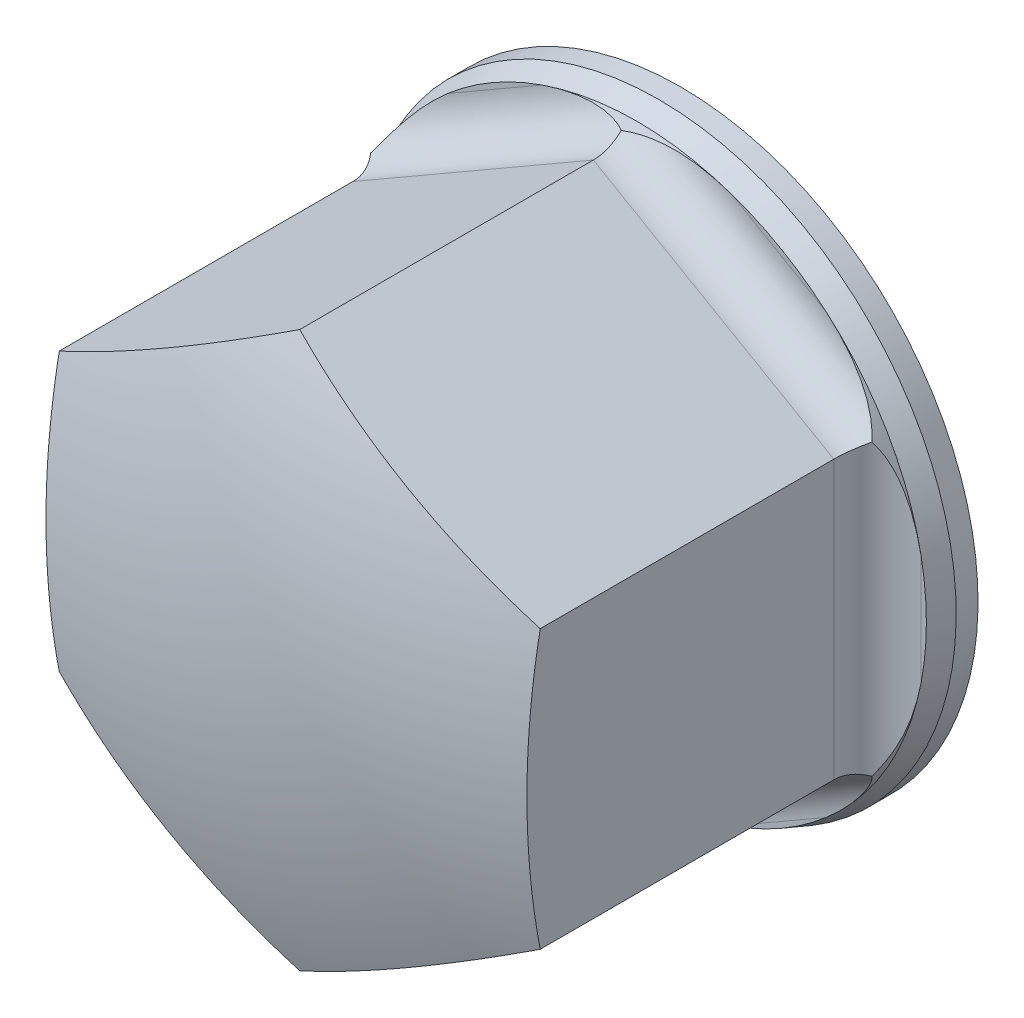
ISO-10303-21;
HEADER;
FILE_DESCRIPTION(('STEP AP214'),'2;1');
FILE_NAME('part.step','',(''),(''),'','','');
FILE_SCHEMA(('AUTOMOTIVE_DESIGN { 1 0 10303 214 1 1 1 1 }'));
ENDSEC;
DATA;
#1=APPLICATION_CONTEXT('core data for automotive mechanical design processes');
#2=APPLICATION_PROTOCOL_DEFINITION('international standard','automotive_design',2000,#1);
#3=PRODUCT_CONTEXT('',#1,'mechanical');
#4=PRODUCT('Part','Part','',(#3));
#5=PRODUCT_RELATED_PRODUCT_CATEGORY('part','',(#4));
#6=PRODUCT_DEFINITION_FORMATION('','',#4);
#7=PRODUCT_DEFINITION_CONTEXT('part definition',#1,'design');
#8=PRODUCT_DEFINITION('design','',#6,#7);
#9=PRODUCT_DEFINITION_SHAPE('','',#8);
#10=(LENGTH_UNIT() NAMED_UNIT(*) SI_UNIT(.MILLI.,.METRE.));
#11=(NAMED_UNIT(*) PLANE_ANGLE_UNIT() SI_UNIT($,.RADIAN.));
#12=(NAMED_UNIT(*) SI_UNIT($,.STERADIAN.) SOLID_ANGLE_UNIT());
#13=UNCERTAINTY_MEASURE_WITH_UNIT(LENGTH_MEASURE(1.E-05),#10,'distance_accuracy_value','');
#14=(GEOMETRIC_REPRESENTATION_CONTEXT(3) GLOBAL_UNCERTAINTY_ASSIGNED_CONTEXT((#13)) GLOBAL_UNIT_ASSIGNED_CONTEXT((#10,
#11,#12)) REPRESENTATION_CONTEXT('',''));
#15=CARTESIAN_POINT('',(0.,0.,0.));
#16=DIRECTION('',(0.,0.,1.));
#17=DIRECTION('',(1.,0.,0.));
#18=AXIS2_PLACEMENT_3D('',#15,#16,#17);
#19=CARTESIAN_POINT('',(0.,0.,0.));
#20=DIRECTION('',(0.,0.,-1.));
#21=DIRECTION('',(0.,1.,0.));
#22=AXIS2_PLACEMENT_3D('',#19,#20,#21);
#23=CYLINDRICAL_SURFACE('',#22,3.4);
#24=CARTESIAN_POINT('',(0.,0.,0.));
#25=DIRECTION('',(0.,0.,-1.));
#26=DIRECTION('',(0.,1.,0.));
#27=AXIS2_PLACEMENT_3D('',#24,#25,#26);
#28=CIRCLE('',#27,3.4);
#29=CARTESIAN_POINT('',(0.,3.4,0.));
#30=VERTEX_POINT('',#29);
#31=EDGE_CURVE('E177',#30,#30,#28,.T.);
#32=ORIENTED_EDGE('',*,*,#31,.F.);
#33=EDGE_LOOP('',(#32));
#34=FACE_BOUND('',#33,.T.);
#35=CARTESIAN_POINT('',(0.,0.,0.25));
#36=DIRECTION('',(0.,0.,-1.));
#37=DIRECTION('',(0.,1.,0.));
#38=AXIS2_PLACEMENT_3D('',#35,#36,#37);
#39=CIRCLE('',#38,3.4);
#40=CARTESIAN_POINT('',(0.,3.4,0.25));
#41=VERTEX_POINT('',#40);
#42=EDGE_CURVE('E138',#41,#41,#39,.T.);
#43=ORIENTED_EDGE('',*,*,#42,.T.);
#44=EDGE_LOOP('',(#43));
#45=FACE_BOUND('',#44,.T.);
#46=ADVANCED_FACE('F14',(#34,#45),#23,.T.);
#47=CARTESIAN_POINT('',(3.4,0.,0.));
#48=DIRECTION('',(0.,0.,1.));
#49=DIRECTION('',(0.,-1.,0.));
#50=AXIS2_PLACEMENT_3D('',#47,#48,#49);
#51=PLANE('',#50);
#52=CARTESIAN_POINT('',(0.,0.,0.));
#53=DIRECTION('',(0.,0.,-1.));
#54=DIRECTION('',(-1.,0.,0.));
#55=AXIS2_PLACEMENT_3D('',#52,#53,#54);
#56=CIRCLE('',#55,1.5);
#57=CARTESIAN_POINT('',(-1.5,0.,0.));
#58=VERTEX_POINT('',#57);
#59=EDGE_CURVE('E333',#58,#58,#56,.T.);
#60=ORIENTED_EDGE('',*,*,#59,.F.);
#61=EDGE_LOOP('',(#60));
#62=FACE_BOUND('',#61,.T.);
#63=ORIENTED_EDGE('',*,*,#31,.T.);
#64=EDGE_LOOP('',(#63));
#65=FACE_BOUND('',#64,.T.);
#66=ADVANCED_FACE('F317',(#62,#65),#51,.F.);
#67=CARTESIAN_POINT('',(0.,0.,0.25));
#68=DIRECTION('',(0.,0.,-1.));
#69=DIRECTION('',(0.,1.,0.));
#70=AXIS2_PLACEMENT_3D('',#67,#68,#69);
#71=CYLINDRICAL_SURFACE('',#70,3.30900744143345);
#72=CARTESIAN_POINT('',(-2.82661530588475,-1.7204,0.734019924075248));
#73=CARTESIAN_POINT('',(-2.83525178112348,-1.70621552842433,0.720292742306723));
#74=CARTESIAN_POINT('',(-2.84417088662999,-1.69131562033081,0.707555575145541));
#75=CARTESIAN_POINT('',(-2.86232343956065,-1.66040685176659,0.683881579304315));
#76=CARTESIAN_POINT('',(-2.87155581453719,-1.64440161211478,0.672939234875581));
#77=CARTESIAN_POINT('',(-2.89915169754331,-1.59556545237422,0.642726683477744));
#78=CARTESIAN_POINT('',(-2.91768845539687,-1.56146842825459,0.625669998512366));
#79=CARTESIAN_POINT('',(-2.95192436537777,-1.49561987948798,0.598043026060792));
#80=CARTESIAN_POINT('',(-2.96768584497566,-1.46411727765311,0.58692515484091));
#81=CARTESIAN_POINT('',(-2.9985032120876,-1.39991992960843,0.567470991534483));
#82=CARTESIAN_POINT('',(-3.01355876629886,-1.36722463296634,0.55913600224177));
#83=CARTESIAN_POINT('',(-3.04295367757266,-1.30050441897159,0.544583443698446));
#84=CARTESIAN_POINT('',(-3.05728030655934,-1.26646738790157,0.538396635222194));
#85=CARTESIAN_POINT('',(-3.08487374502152,-1.19768857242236,0.527822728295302));
#86=CARTESIAN_POINT('',(-3.09814028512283,-1.16294661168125,0.523436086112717));
#87=CARTESIAN_POINT('',(-3.12589431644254,-1.08640042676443,0.515393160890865));
#88=CARTESIAN_POINT('',(-3.14015094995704,-1.04448295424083,0.51202383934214));
#89=CARTESIAN_POINT('',(-3.16699514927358,-0.960019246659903,0.506748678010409));
#90=CARTESIAN_POINT('',(-3.17958223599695,-0.917472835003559,0.504843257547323));
#91=CARTESIAN_POINT('',(-3.20273801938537,-0.832987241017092,0.502105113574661));
#92=CARTESIAN_POINT('',(-3.21335051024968,-0.791060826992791,0.501245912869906));
#93=CARTESIAN_POINT('',(-3.23291921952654,-0.706846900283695,0.500198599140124));
#94=CARTESIAN_POINT('',(-3.2418766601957,-0.664559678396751,0.500009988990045));
#95=CARTESIAN_POINT('',(-3.25,-0.6221175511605,0.5));
#96=B_SPLINE_CURVE_WITH_KNOTS('',3,(#72,#73,#74,#75,#76,#77,#78,#79,#80,#81,#82,#83,#84,#85,#86,
#87,#88,#89,#90,#91,#92,#93,#94,#95),.UNSPECIFIED.,.F.,.F.,(4,2,2,2,2,2,2,2,2,2,2,4),(0.,
0.064531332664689,0.128860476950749,0.255568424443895,0.366247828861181,0.476978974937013,
0.589235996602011,0.70152145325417,0.834661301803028,0.967839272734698,1.09757169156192,
1.22720791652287),.UNSPECIFIED.);
#97=CARTESIAN_POINT('',(-2.86568450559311,-1.65450372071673,0.680153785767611));
#98=VERTEX_POINT('',#97);
#99=CARTESIAN_POINT('',(-3.25,-0.622117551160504,0.5));
#100=VERTEX_POINT('',#99);
#101=EDGE_CURVE('E272',#98,#100,#96,.T.);
#102=ORIENTED_EDGE('',*,*,#101,.T.);
#103=CARTESIAN_POINT('',(0.,0.,0.5));
#104=DIRECTION('',(0.,0.,-1.));
#105=DIRECTION('',(0.,1.,0.));
#106=AXIS2_PLACEMENT_3D('',#103,#104,#105);
#107=CIRCLE('',#106,3.30900744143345);
#108=CARTESIAN_POINT('',(-2.16376960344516,-2.50352378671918,0.5));
#109=VERTEX_POINT('',#108);
#110=EDGE_CURVE('E574',#109,#100,#107,.T.);
#111=ORIENTED_EDGE('',*,*,#110,.F.);
#112=CARTESIAN_POINT('',(-2.16376960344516,-2.50352378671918,0.5));
#113=CARTESIAN_POINT('',(-2.20783140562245,-2.46544678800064,0.500034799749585));
#114=CARTESIAN_POINT('',(-2.25089723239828,-2.42618845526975,0.500362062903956));
#115=CARTESIAN_POINT('',(-2.33502443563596,-2.34533577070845,0.502437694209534));
#116=CARTESIAN_POINT('',(-2.37607834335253,-2.3037337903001,0.504190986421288));
#117=CARTESIAN_POINT('',(-2.45745468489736,-2.2167844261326,0.510081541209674));
#118=CARTESIAN_POINT('',(-2.49768241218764,-2.17135381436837,0.514311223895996));
#119=CARTESIAN_POINT('',(-2.57530217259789,-2.07869894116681,0.526525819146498));
#120=CARTESIAN_POINT('',(-2.61269890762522,-2.03147785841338,0.534504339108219));
#121=CARTESIAN_POINT('',(-2.68091287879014,-1.94040172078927,0.554963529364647));
#122=CARTESIAN_POINT('',(-2.71201758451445,-1.89665387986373,0.566943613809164));
#123=CARTESIAN_POINT('',(-2.7707707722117,-1.80971276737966,0.597101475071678));
#124=CARTESIAN_POINT('',(-2.79845929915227,-1.7665197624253,0.615195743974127));
#125=CARTESIAN_POINT('',(-2.83876054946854,-1.70051507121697,0.650390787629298));
#126=CARTESIAN_POINT('',(-2.85271026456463,-1.67697560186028,0.664530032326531));
#127=CARTESIAN_POINT('',(-2.87918103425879,-1.63112712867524,0.696405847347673));
#128=CARTESIAN_POINT('',(-2.89168392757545,-1.60883527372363,0.714181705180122));
#129=CARTESIAN_POINT('',(-2.90321775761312,-1.58772066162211,0.734019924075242));
#130=B_SPLINE_CURVE_WITH_KNOTS('',3,(#112,#113,#114,#115,#116,#117,#118,#119,#120,#121,#122,
#123,#124,#125,#126,#127,#128,#129),.UNSPECIFIED.,.F.,.F.,(4,2,2,2,2,2,2,2,4),(0.,
0.174713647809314,0.350033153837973,0.532355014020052,0.714367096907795,0.879061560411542,
1.04159189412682,1.13375504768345,1.22697211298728),.UNSPECIFIED.);
#131=EDGE_CURVE('E267',#109,#98,#130,.T.);
#132=ORIENTED_EDGE('',*,*,#131,.T.);
#133=EDGE_LOOP('',(#102,#111,#132));
#134=FACE_BOUND('',#133,.T.);
#135=ADVANCED_FACE('F202',(#134),#71,.T.);
#136=CARTESIAN_POINT('',(2.82661530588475,1.7204,0.734019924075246));
#137=CARTESIAN_POINT('',(2.83525178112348,1.70621552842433,0.720292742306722));
#138=CARTESIAN_POINT('',(2.84417088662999,1.69131562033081,0.707555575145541));
#139=CARTESIAN_POINT('',(2.86232343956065,1.66040685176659,0.683881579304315));
#140=CARTESIAN_POINT('',(2.8715558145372,1.64440161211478,0.672939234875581));
#141=CARTESIAN_POINT('',(2.89915169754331,1.59556545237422,0.642726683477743));
#142=CARTESIAN_POINT('',(2.91768845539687,1.56146842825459,0.625669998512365));
#143=CARTESIAN_POINT('',(2.95192436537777,1.49561987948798,0.598043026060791));
#144=CARTESIAN_POINT('',(2.96768584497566,1.46411727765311,0.58692515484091));
#145=CARTESIAN_POINT('',(2.9985032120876,1.39991992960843,0.567470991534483));
#146=CARTESIAN_POINT('',(3.01355876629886,1.36722463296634,0.55913600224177));
#147=CARTESIAN_POINT('',(3.04295367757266,1.30050441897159,0.544583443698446));
#148=CARTESIAN_POINT('',(3.05728030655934,1.26646738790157,0.538396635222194));
#149=CARTESIAN_POINT('',(3.08487374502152,1.19768857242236,0.527822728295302));
#150=CARTESIAN_POINT('',(3.09814028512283,1.16294661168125,0.523436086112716));
#151=CARTESIAN_POINT('',(3.12589431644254,1.08640042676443,0.515393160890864));
#152=CARTESIAN_POINT('',(3.14015094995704,1.04448295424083,0.51202383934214));
#153=CARTESIAN_POINT('',(3.16699514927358,0.960019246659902,0.506748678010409));
#154=CARTESIAN_POINT('',(3.17958223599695,0.917472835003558,0.504843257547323));
#155=CARTESIAN_POINT('',(3.20273801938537,0.832987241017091,0.502105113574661));
#156=CARTESIAN_POINT('',(3.21335051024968,0.79106082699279,0.501245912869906));
#157=CARTESIAN_POINT('',(3.23291921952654,0.706846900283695,0.500198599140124));
#158=CARTESIAN_POINT('',(3.2418766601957,0.664559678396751,0.500009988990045));
#159=CARTESIAN_POINT('',(3.25,0.6221175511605,0.5));
#160=B_SPLINE_CURVE_WITH_KNOTS('',3,(#136,#137,#138,#139,#140,#141,#142,#143,#144,#145,#146,
#147,#148,#149,#150,#151,#152,#153,#154,#155,#156,#157,#158,#159),.UNSPECIFIED.,.F.,.F.,(4,2,2,
2,2,2,2,2,2,2,2,4),(0.,0.0645313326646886,0.128860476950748,0.255568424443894,0.366247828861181,
0.476978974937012,0.589235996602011,0.701521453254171,0.834661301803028,0.967839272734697,
1.09757169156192,1.22720791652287),.UNSPECIFIED.);
#161=CARTESIAN_POINT('',(2.86568450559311,1.65450372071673,0.680153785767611));
#162=VERTEX_POINT('',#161);
#163=CARTESIAN_POINT('',(3.25,0.622117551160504,0.5));
#164=VERTEX_POINT('',#163);
#165=EDGE_CURVE('E261',#162,#164,#160,.T.);
#166=ORIENTED_EDGE('',*,*,#165,.T.);
#167=CARTESIAN_POINT('',(2.16376960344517,2.50352378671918,0.5));
#168=VERTEX_POINT('',#167);
#169=EDGE_CURVE('E134',#168,#164,#107,.T.);
#170=ORIENTED_EDGE('',*,*,#169,.F.);
#171=CARTESIAN_POINT('',(2.16376960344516,2.50352378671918,0.5));
#172=CARTESIAN_POINT('',(2.20783140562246,2.46544678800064,0.500034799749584));
#173=CARTESIAN_POINT('',(2.25089723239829,2.42618845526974,0.500362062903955));
#174=CARTESIAN_POINT('',(2.33502443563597,2.34533577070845,0.502437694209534));
#175=CARTESIAN_POINT('',(2.37607834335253,2.30373379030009,0.504190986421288));
#176=CARTESIAN_POINT('',(2.45745468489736,2.2167844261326,0.510081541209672));
#177=CARTESIAN_POINT('',(2.49768241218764,2.17135381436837,0.514311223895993));
#178=CARTESIAN_POINT('',(2.57530217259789,2.07869894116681,0.526525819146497));
#179=CARTESIAN_POINT('',(2.61269890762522,2.03147785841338,0.53450433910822));
#180=CARTESIAN_POINT('',(2.68091287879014,1.94040172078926,0.554963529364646));
#181=CARTESIAN_POINT('',(2.71201758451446,1.89665387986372,0.566943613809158));
#182=CARTESIAN_POINT('',(2.7707707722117,1.80971276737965,0.597101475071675));
#183=CARTESIAN_POINT('',(2.79845929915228,1.7665197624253,0.61519574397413));
#184=CARTESIAN_POINT('',(2.83876054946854,1.70051507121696,0.650390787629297));
#185=CARTESIAN_POINT('',(2.85271026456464,1.67697560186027,0.664530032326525));
#186=CARTESIAN_POINT('',(2.87918103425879,1.63112712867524,0.696405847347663));
#187=CARTESIAN_POINT('',(2.89168392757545,1.60883527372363,0.714181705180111));
#188=CARTESIAN_POINT('',(2.90321775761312,1.58772066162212,0.734019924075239));
#189=B_SPLINE_CURVE_WITH_KNOTS('',3,(#171,#172,#173,#174,#175,#176,#177,#178,#179,#180,#181,
#182,#183,#184,#185,#186,#187,#188),.UNSPECIFIED.,.F.,.F.,(4,2,2,2,2,2,2,2,4),(0.,
0.174713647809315,0.350033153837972,0.532355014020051,0.714367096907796,0.879061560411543,
1.04159189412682,1.13375504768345,1.22697211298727),.UNSPECIFIED.);
#190=EDGE_CURVE('E255',#168,#162,#189,.T.);
#191=ORIENTED_EDGE('',*,*,#190,.T.);
#192=EDGE_LOOP('',(#166,#170,#191));
#193=FACE_BOUND('',#192,.T.);
#194=ADVANCED_FACE('F508',(#193),#71,.T.);
#195=CARTESIAN_POINT('',(-3.25,0.6221175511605,0.5));
#196=CARTESIAN_POINT('',(-3.23905525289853,0.679314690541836,0.500034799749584));
#197=CARTESIAN_POINT('',(-3.22658945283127,0.736239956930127,0.500362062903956));
#198=CARTESIAN_POINT('',(-3.19863257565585,0.849522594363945,0.502437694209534));
#199=CARTESIAN_POINT('',(-3.18313115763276,0.905877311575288,0.504190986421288));
#200=CARTESIAN_POINT('',(-3.14851897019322,1.0198259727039,0.510081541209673));
#201=CARTESIAN_POINT('',(-3.12928876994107,1.07737951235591,0.514311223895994));
#202=CARTESIAN_POINT('',(-3.08785717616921,1.19092763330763,0.526525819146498));
#203=CARTESIAN_POINT('',(-3.0656608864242,1.24692469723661,0.534504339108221));
#204=CARTESIAN_POINT('',(-3.02089362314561,1.3515377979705,0.554963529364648));
#205=CARTESIAN_POINT('',(-2.99855923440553,1.40034918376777,0.566943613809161));
#206=CARTESIAN_POINT('',(-2.95264261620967,1.49470149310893,0.597101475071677));
#207=CARTESIAN_POINT('',(-2.9290806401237,1.54027696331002,0.615195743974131));
#208=CARTESIAN_POINT('',(-2.89206952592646,1.60818121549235,0.650390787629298));
#209=CARTESIAN_POINT('',(-2.87865860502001,1.63203175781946,0.664530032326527));
#210=CARTESIAN_POINT('',(-2.85218804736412,1.67788035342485,0.696405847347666));
#211=CARTESIAN_POINT('',(-2.83913418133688,1.69985410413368,0.714181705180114));
#212=CARTESIAN_POINT('',(-2.82661530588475,1.7204,0.734019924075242));
#213=B_SPLINE_CURVE_WITH_KNOTS('',3,(#195,#196,#197,#198,#199,#200,#201,#202,#203,#204,#205,
#206,#207,#208,#209,#210,#211,#212),.UNSPECIFIED.,.F.,.F.,(4,2,2,2,2,2,2,2,4),(0.,
0.174713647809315,0.350033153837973,0.532355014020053,0.714367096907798,0.879061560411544,
1.04159189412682,1.13375504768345,1.22697211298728),.UNSPECIFIED.);
#214=CARTESIAN_POINT('',(-3.25,0.622117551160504,0.5));
#215=VERTEX_POINT('',#214);
#216=CARTESIAN_POINT('',(-2.86568450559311,1.65450372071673,0.68015378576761));
#217=VERTEX_POINT('',#216);
#218=EDGE_CURVE('E247',#215,#217,#213,.T.);
#219=ORIENTED_EDGE('',*,*,#218,.T.);
#220=CARTESIAN_POINT('',(-2.90321775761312,1.58772066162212,0.734019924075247));
#221=CARTESIAN_POINT('',(-2.8952518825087,1.60229230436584,0.720292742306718));
#222=CARTESIAN_POINT('',(-2.88680773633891,1.61746643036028,0.707555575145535));
#223=CARTESIAN_POINT('',(-2.86911623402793,1.64864138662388,0.683881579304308));
#224=CARTESIAN_POINT('',(-2.85987147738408,1.66463947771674,0.672939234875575));
#225=CARTESIAN_POINT('',(-2.83137606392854,1.71295629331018,0.64272668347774));
#226=CARTESIAN_POINT('',(-2.81111555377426,1.74605810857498,0.625669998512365));
#227=CARTESIAN_POINT('',(-2.7712069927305,1.80863155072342,0.598043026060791));
#228=CARTESIAN_POINT('',(-2.75180567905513,1.83803269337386,0.586925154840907));
#229=CARTESIAN_POINT('',(-2.71161782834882,1.89681999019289,0.56747099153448));
#230=CARTESIAN_POINT('',(-2.69083064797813,1.92620613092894,0.559136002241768));
#231=CARTESIAN_POINT('',(-2.64774670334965,1.98502297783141,0.544583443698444));
#232=CARTESIAN_POINT('',(-2.62543308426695,2.01444871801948,0.538396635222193));
#233=CARTESIAN_POINT('',(-2.57966560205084,2.0727347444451,0.527822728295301));
#234=CARTESIAN_POINT('',(-2.55621145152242,2.10159488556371,0.523436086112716));
#235=CARTESIAN_POINT('',(-2.50379752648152,2.16390367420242,0.515393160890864));
#236=CARTESIAN_POINT('',(-2.4746242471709,2.19720901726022,0.512023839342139));
#237=CARTESIAN_POINT('',(-2.41489863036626,2.26268862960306,0.506748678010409));
#238=CARTESIAN_POINT('',(-2.38434590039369,2.29486257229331,0.504843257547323));
#239=CARTESIAN_POINT('',(-2.32275712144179,2.35715886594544,0.502105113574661));
#240=CARTESIAN_POINT('',(-2.29175402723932,2.38731275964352,0.501245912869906));
#241=CARTESIAN_POINT('',(-2.22860698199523,2.4463667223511,0.500198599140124));
#242=CARTESIAN_POINT('',(-2.19646389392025,2.47526770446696,0.500009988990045));
#243=CARTESIAN_POINT('',(-2.16376960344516,2.50352378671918,0.5));
#244=B_SPLINE_CURVE_WITH_KNOTS('',3,(#220,#221,#222,#223,#224,#225,#226,#227,#228,#229,#230,
#231,#232,#233,#234,#235,#236,#237,#238,#239,#240,#241,#242,#243),.UNSPECIFIED.,.F.,.F.,(4,2,2,
2,2,2,2,2,2,2,2,4),(0.,0.064531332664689,0.128860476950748,0.255568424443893,0.366247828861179,
0.476978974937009,0.589235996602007,0.701521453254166,0.834661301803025,0.967839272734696,
1.09757169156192,1.22720791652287),.UNSPECIFIED.);
#245=CARTESIAN_POINT('',(-2.16376960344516,2.50352378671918,0.5));
#246=VERTEX_POINT('',#245);
#247=EDGE_CURVE('E240',#217,#246,#244,.T.);
#248=ORIENTED_EDGE('',*,*,#247,.T.);
#249=EDGE_CURVE('E587',#215,#246,#107,.T.);
#250=ORIENTED_EDGE('',*,*,#249,.F.);
#251=EDGE_LOOP('',(#219,#248,#250));
#252=FACE_BOUND('',#251,.T.);
#253=ADVANCED_FACE('F500',(#252),#71,.T.);
#254=CARTESIAN_POINT('',(-0.0766024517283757,3.30812066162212,0.73401992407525));
#255=CARTESIAN_POINT('',(-0.0600001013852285,3.30850783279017,0.720292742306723));
#256=CARTESIAN_POINT('',(-0.0426368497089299,3.30878205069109,0.70755557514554));
#257=CARTESIAN_POINT('',(-0.00679279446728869,3.30904823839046,0.683881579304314));
#258=CARTESIAN_POINT('',(0.0116843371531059,3.30904108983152,0.672939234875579));
#259=CARTESIAN_POINT('',(0.0677756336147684,3.3085217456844,0.642726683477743));
#260=CARTESIAN_POINT('',(0.106572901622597,3.30752653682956,0.625669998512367));
#261=CARTESIAN_POINT('',(0.180717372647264,3.3042514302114,0.598043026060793));
#262=CARTESIAN_POINT('',(0.215880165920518,3.30214997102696,0.58692515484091));
#263=CARTESIAN_POINT('',(0.286885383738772,3.29673991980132,0.567470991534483));
#264=CARTESIAN_POINT('',(0.322728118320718,3.29343076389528,0.55913600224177));
#265=CARTESIAN_POINT('',(0.395206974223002,3.285527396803,0.544583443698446));
#266=CARTESIAN_POINT('',(0.431847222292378,3.28091610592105,0.538396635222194));
#267=CARTESIAN_POINT('',(0.505208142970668,3.27042331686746,0.527822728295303));
#268=CARTESIAN_POINT('',(0.541928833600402,3.26454149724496,0.523436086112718));
#269=CARTESIAN_POINT('',(0.622096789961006,3.25030410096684,0.515393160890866));
#270=CARTESIAN_POINT('',(0.665526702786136,3.24169197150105,0.51202383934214));
#271=CARTESIAN_POINT('',(0.752096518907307,3.22270787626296,0.506748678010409));
#272=CARTESIAN_POINT('',(0.795236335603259,3.21233540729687,0.504843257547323));
#273=CARTESIAN_POINT('',(0.879980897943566,3.19014610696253,0.502105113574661));
#274=CARTESIAN_POINT('',(0.921596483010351,3.17837358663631,0.501245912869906));
#275=CARTESIAN_POINT('',(1.0043122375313,3.15321362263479,0.500198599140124));
#276=CARTESIAN_POINT('',(1.04541276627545,3.1398273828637,0.500009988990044));
#277=CARTESIAN_POINT('',(1.08623039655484,3.12564133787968,0.5));
#278=B_SPLINE_CURVE_WITH_KNOTS('',3,(#254,#255,#256,#257,#258,#259,#260,#261,#262,#263,#264,
#265,#266,#267,#268,#269,#270,#271,#272,#273,#274,#275,#276,#277),.UNSPECIFIED.,.F.,.F.,(4,2,2,
2,2,2,2,2,2,2,2,4),(0.,0.0645313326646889,0.128860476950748,0.255568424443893,0.366247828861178,
0.476978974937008,0.589235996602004,0.701521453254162,0.834661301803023,0.967839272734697,
1.09757169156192,1.22720791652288),.UNSPECIFIED.);
#279=CARTESIAN_POINT('',(0.,3.30900744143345,0.680153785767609));
#280=VERTEX_POINT('',#279);
#281=CARTESIAN_POINT('',(1.08623039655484,3.12564133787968,0.5));
#282=VERTEX_POINT('',#281);
#283=EDGE_CURVE('E232',#280,#282,#278,.T.);
#284=ORIENTED_EDGE('',*,*,#283,.T.);
#285=CARTESIAN_POINT('',(-1.08623039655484,3.12564133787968,0.5));
#286=VERTEX_POINT('',#285);
#287=EDGE_CURVE('E594',#286,#282,#107,.T.);
#288=ORIENTED_EDGE('',*,*,#287,.F.);
#289=CARTESIAN_POINT('',(-1.08623039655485,3.12564133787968,0.5));
#290=CARTESIAN_POINT('',(-1.03122384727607,3.14476147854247,0.500034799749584));
#291=CARTESIAN_POINT('',(-0.975692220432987,3.16242841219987,0.500362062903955));
#292=CARTESIAN_POINT('',(-0.863608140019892,3.19485836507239,0.502437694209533));
#293=CARTESIAN_POINT('',(-0.807052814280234,3.20961110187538,0.504190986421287));
#294=CARTESIAN_POINT('',(-0.691064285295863,3.2366103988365,0.510081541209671));
#295=CARTESIAN_POINT('',(-0.631606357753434,3.24873332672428,0.514311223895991));
#296=CARTESIAN_POINT('',(-0.512555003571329,3.26962657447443,0.526525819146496));
#297=CARTESIAN_POINT('',(-0.452961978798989,3.27840255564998,0.534504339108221));
#298=CARTESIAN_POINT('',(-0.339980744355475,3.29193951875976,0.554963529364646));
#299=CARTESIAN_POINT('',(-0.286541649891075,3.29700306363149,0.566943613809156));
#300=CARTESIAN_POINT('',(-0.18187184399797,3.30441426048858,0.597101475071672));
#301=CARTESIAN_POINT('',(-0.130621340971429,3.30679672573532,0.61519574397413));
#302=CARTESIAN_POINT('',(-0.0533089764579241,3.30869628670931,0.650390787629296));
#303=CARTESIAN_POINT('',(-0.0259483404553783,3.30900735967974,0.664530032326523));
#304=CARTESIAN_POINT('',(0.0269929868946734,3.30900748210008,0.69640584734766));
#305=CARTESIAN_POINT('',(0.0525497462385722,3.30868937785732,0.714181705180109));
#306=CARTESIAN_POINT('',(0.0766024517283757,3.30812066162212,0.73401992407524));
#307=B_SPLINE_CURVE_WITH_KNOTS('',3,(#289,#290,#291,#292,#293,#294,#295,#296,#297,#298,#299,
#300,#301,#302,#303,#304,#305,#306),.UNSPECIFIED.,.F.,.F.,(4,2,2,2,2,2,2,2,4),(0.,
0.174713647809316,0.350033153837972,0.532355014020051,0.714367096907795,0.879061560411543,
1.04159189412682,1.13375504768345,1.22697211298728),.UNSPECIFIED.);
#308=EDGE_CURVE('E153',#286,#280,#307,.T.);
#309=ORIENTED_EDGE('',*,*,#308,.T.);
#310=EDGE_LOOP('',(#284,#288,#309));
#311=FACE_BOUND('',#310,.T.);
#312=ADVANCED_FACE('F493',(#311),#71,.T.);
#313=CARTESIAN_POINT('',(3.25,-0.6221175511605,0.5));
#314=CARTESIAN_POINT('',(3.23905525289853,-0.679314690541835,0.500034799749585));
#315=CARTESIAN_POINT('',(3.22658945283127,-0.736239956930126,0.500362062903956));
#316=CARTESIAN_POINT('',(3.19863257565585,-0.849522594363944,0.502437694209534));
#317=CARTESIAN_POINT('',(3.18313115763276,-0.905877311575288,0.504190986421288));
#318=CARTESIAN_POINT('',(3.14851897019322,-1.0198259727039,0.510081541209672));
#319=CARTESIAN_POINT('',(3.12928876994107,-1.07737951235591,0.514311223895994));
#320=CARTESIAN_POINT('',(3.08785717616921,-1.19092763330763,0.526525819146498));
#321=CARTESIAN_POINT('',(3.0656608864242,-1.2469246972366,0.534504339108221));
#322=CARTESIAN_POINT('',(3.02089362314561,-1.3515377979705,0.554963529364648));
#323=CARTESIAN_POINT('',(2.99855923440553,-1.40034918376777,0.56694361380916));
#324=CARTESIAN_POINT('',(2.95264261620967,-1.49470149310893,0.597101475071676));
#325=CARTESIAN_POINT('',(2.9290806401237,-1.54027696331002,0.61519574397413));
#326=CARTESIAN_POINT('',(2.89206952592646,-1.60818121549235,0.650390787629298));
#327=CARTESIAN_POINT('',(2.87865860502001,-1.63203175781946,0.664530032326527));
#328=CARTESIAN_POINT('',(2.85218804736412,-1.67788035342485,0.696405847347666));
#329=CARTESIAN_POINT('',(2.83913418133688,-1.69985410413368,0.714181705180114));
#330=CARTESIAN_POINT('',(2.82661530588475,-1.7204,0.73401992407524));
#331=B_SPLINE_CURVE_WITH_KNOTS('',3,(#313,#314,#315,#316,#317,#318,#319,#320,#321,#322,#323,
#324,#325,#326,#327,#328,#329,#330),.UNSPECIFIED.,.F.,.F.,(4,2,2,2,2,2,2,2,4),(0.,
0.174713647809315,0.350033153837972,0.532355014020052,0.714367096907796,0.879061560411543,
1.04159189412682,1.13375504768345,1.22697211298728),.UNSPECIFIED.);
#332=CARTESIAN_POINT('',(3.25,-0.622117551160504,0.5));
#333=VERTEX_POINT('',#332);
#334=CARTESIAN_POINT('',(2.86568450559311,-1.65450372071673,0.680153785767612));
#335=VERTEX_POINT('',#334);
#336=EDGE_CURVE('E143',#333,#335,#331,.T.);
#337=ORIENTED_EDGE('',*,*,#336,.T.);
#338=CARTESIAN_POINT('',(2.90321775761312,-1.58772066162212,0.734019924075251));
#339=CARTESIAN_POINT('',(2.8952518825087,-1.60229230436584,0.720292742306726));
#340=CARTESIAN_POINT('',(2.88680773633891,-1.61746643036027,0.707555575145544));
#341=CARTESIAN_POINT('',(2.86911623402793,-1.64864138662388,0.683881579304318));
#342=CARTESIAN_POINT('',(2.85987147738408,-1.66463947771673,0.672939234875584));
#343=CARTESIAN_POINT('',(2.83137606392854,-1.71295629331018,0.642726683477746));
#344=CARTESIAN_POINT('',(2.81111555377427,-1.74605810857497,0.625669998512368));
#345=CARTESIAN_POINT('',(2.7712069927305,-1.80863155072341,0.598043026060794));
#346=CARTESIAN_POINT('',(2.75180567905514,-1.83803269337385,0.586925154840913));
#347=CARTESIAN_POINT('',(2.71161782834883,-1.89681999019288,0.567470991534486));
#348=CARTESIAN_POINT('',(2.69083064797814,-1.92620613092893,0.559136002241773));
#349=CARTESIAN_POINT('',(2.64774670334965,-1.9850229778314,0.544583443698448));
#350=CARTESIAN_POINT('',(2.62543308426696,-2.01444871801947,0.538396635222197));
#351=CARTESIAN_POINT('',(2.57966560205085,-2.07273474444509,0.527822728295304));
#352=CARTESIAN_POINT('',(2.55621145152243,-2.1015948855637,0.523436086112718));
#353=CARTESIAN_POINT('',(2.50379752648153,-2.16390367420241,0.515393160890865));
#354=CARTESIAN_POINT('',(2.47462424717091,-2.19720901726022,0.512023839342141));
#355=CARTESIAN_POINT('',(2.41489863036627,-2.26268862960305,0.50674867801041));
#356=CARTESIAN_POINT('',(2.38434590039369,-2.29486257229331,0.504843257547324));
#357=CARTESIAN_POINT('',(2.3227571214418,-2.35715886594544,0.502105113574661));
#358=CARTESIAN_POINT('',(2.29175402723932,-2.38731275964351,0.501245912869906));
#359=CARTESIAN_POINT('',(2.22860698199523,-2.44636672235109,0.500198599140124));
#360=CARTESIAN_POINT('',(2.19646389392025,-2.47526770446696,0.500009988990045));
#361=CARTESIAN_POINT('',(2.16376960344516,-2.50352378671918,0.5));
#362=B_SPLINE_CURVE_WITH_KNOTS('',3,(#338,#339,#340,#341,#342,#343,#344,#345,#346,#347,#348,
#349,#350,#351,#352,#353,#354,#355,#356,#357,#358,#359,#360,#361),.UNSPECIFIED.,.F.,.F.,(4,2,2,
2,2,2,2,2,2,2,2,4),(0.,0.0645313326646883,0.128860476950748,0.255568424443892,0.366247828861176,
0.476978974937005,0.589235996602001,0.701521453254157,0.83466130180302,0.967839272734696,
1.09757169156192,1.22720791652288),.UNSPECIFIED.);
#363=CARTESIAN_POINT('',(2.16376960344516,-2.50352378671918,0.5));
#364=VERTEX_POINT('',#363);
#365=EDGE_CURVE('E9',#335,#364,#362,.T.);
#366=ORIENTED_EDGE('',*,*,#365,.T.);
#367=EDGE_CURVE('E132',#333,#364,#107,.T.);
#368=ORIENTED_EDGE('',*,*,#367,.F.);
#369=EDGE_LOOP('',(#337,#366,#368));
#370=FACE_BOUND('',#369,.T.);
#371=ADVANCED_FACE('F142',(#370),#71,.T.);
#372=CARTESIAN_POINT('',(0.076602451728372,-3.30812066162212,0.73401992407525));
#373=CARTESIAN_POINT('',(0.0600001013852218,-3.30850783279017,0.720292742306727));
#374=CARTESIAN_POINT('',(0.0426368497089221,-3.30878205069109,0.707555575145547));
#375=CARTESIAN_POINT('',(0.00679279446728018,-3.30904823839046,0.683881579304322));
#376=CARTESIAN_POINT('',(-0.011684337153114,-3.30904108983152,0.672939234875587));
#377=CARTESIAN_POINT('',(-0.0677756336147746,-3.3085217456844,0.642726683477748));
#378=CARTESIAN_POINT('',(-0.106572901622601,-3.30752653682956,0.625669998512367));
#379=CARTESIAN_POINT('',(-0.180717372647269,-3.3042514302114,0.598043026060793));
#380=CARTESIAN_POINT('',(-0.215880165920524,-3.30214997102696,0.586925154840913));
#381=CARTESIAN_POINT('',(-0.28688538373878,-3.29673991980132,0.567470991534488));
#382=CARTESIAN_POINT('',(-0.322728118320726,-3.29343076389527,0.559136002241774));
#383=CARTESIAN_POINT('',(-0.395206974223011,-3.285527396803,0.544583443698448));
#384=CARTESIAN_POINT('',(-0.431847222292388,-3.28091610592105,0.538396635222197));
#385=CARTESIAN_POINT('',(-0.505208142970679,-3.27042331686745,0.527822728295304));
#386=CARTESIAN_POINT('',(-0.541928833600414,-3.26454149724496,0.523436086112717));
#387=CARTESIAN_POINT('',(-0.622096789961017,-3.25030410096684,0.515393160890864));
#388=CARTESIAN_POINT('',(-0.665526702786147,-3.24169197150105,0.512023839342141));
#389=CARTESIAN_POINT('',(-0.752096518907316,-3.22270787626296,0.506748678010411));
#390=CARTESIAN_POINT('',(-0.795236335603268,-3.21233540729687,0.504843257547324));
#391=CARTESIAN_POINT('',(-0.879980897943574,-3.19014610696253,0.502105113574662));
#392=CARTESIAN_POINT('',(-0.921596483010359,-3.1783735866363,0.501245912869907));
#393=CARTESIAN_POINT('',(-1.00431223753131,-3.15321362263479,0.500198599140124));
#394=CARTESIAN_POINT('',(-1.04541276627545,-3.1398273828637,0.500009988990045));
#395=CARTESIAN_POINT('',(-1.08623039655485,-3.12564133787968,0.5));
#396=B_SPLINE_CURVE_WITH_KNOTS('',3,(#372,#373,#374,#375,#376,#377,#378,#379,#380,#381,#382,
#383,#384,#385,#386,#387,#388,#389,#390,#391,#392,#393,#394,#395),.UNSPECIFIED.,.F.,.F.,(4,2,2,
2,2,2,2,2,2,2,2,4),(0.,0.0645313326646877,0.128860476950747,0.255568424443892,0.366247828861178,
0.47697897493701,0.589235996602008,0.701521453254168,0.834661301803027,0.967839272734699,
1.09757169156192,1.22720791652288),.UNSPECIFIED.);
#397=CARTESIAN_POINT('',(0.,-3.30900744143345,0.68015378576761));
#398=VERTEX_POINT('',#397);
#399=CARTESIAN_POINT('',(-1.08623039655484,-3.12564133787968,0.5));
#400=VERTEX_POINT('',#399);
#401=EDGE_CURVE('E145',#398,#400,#396,.T.);
#402=ORIENTED_EDGE('',*,*,#401,.T.);
#403=CARTESIAN_POINT('',(1.08623039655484,-3.12564133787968,0.5));
#404=VERTEX_POINT('',#403);
#405=EDGE_CURVE('E664',#404,#400,#107,.T.);
#406=ORIENTED_EDGE('',*,*,#405,.F.);
#407=CARTESIAN_POINT('',(1.08623039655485,-3.12564133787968,0.5));
#408=CARTESIAN_POINT('',(1.03122384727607,-3.14476147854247,0.500034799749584));
#409=CARTESIAN_POINT('',(0.975692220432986,-3.16242841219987,0.500362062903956));
#410=CARTESIAN_POINT('',(0.86360814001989,-3.19485836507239,0.502437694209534));
#411=CARTESIAN_POINT('',(0.807052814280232,-3.20961110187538,0.504190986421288));
#412=CARTESIAN_POINT('',(0.691064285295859,-3.2366103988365,0.510081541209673));
#413=CARTESIAN_POINT('',(0.631606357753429,-3.24873332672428,0.514311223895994));
#414=CARTESIAN_POINT('',(0.512555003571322,-3.26962657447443,0.526525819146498));
#415=CARTESIAN_POINT('',(0.452961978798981,-3.27840255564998,0.534504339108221));
#416=CARTESIAN_POINT('',(0.339980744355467,-3.29193951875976,0.554963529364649));
#417=CARTESIAN_POINT('',(0.286541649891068,-3.29700306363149,0.566943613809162));
#418=CARTESIAN_POINT('',(0.181871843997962,-3.30441426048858,0.597101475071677));
#419=CARTESIAN_POINT('',(0.130621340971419,-3.30679672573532,0.615195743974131));
#420=CARTESIAN_POINT('',(0.0533089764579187,-3.30869628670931,0.650390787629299));
#421=CARTESIAN_POINT('',(0.0259483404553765,-3.30900735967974,0.664530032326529));
#422=CARTESIAN_POINT('',(-0.0269929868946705,-3.30900748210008,0.696405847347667));
#423=CARTESIAN_POINT('',(-0.0525497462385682,-3.30868937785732,0.714181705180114));
#424=CARTESIAN_POINT('',(-0.0766024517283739,-3.30812066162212,0.734019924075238));
#425=B_SPLINE_CURVE_WITH_KNOTS('',3,(#407,#408,#409,#410,#411,#412,#413,#414,#415,#416,#417,
#418,#419,#420,#421,#422,#423,#424),.UNSPECIFIED.,.F.,.F.,(4,2,2,2,2,2,2,2,4),(0.,
0.174713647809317,0.350033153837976,0.532355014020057,0.714367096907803,0.879061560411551,
1.04159189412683,1.13375504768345,1.22697211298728),.UNSPECIFIED.);
#426=EDGE_CURVE('E28',#404,#398,#425,.T.);
#427=ORIENTED_EDGE('',*,*,#426,.T.);
#428=EDGE_LOOP('',(#402,#406,#427));
#429=FACE_BOUND('',#428,.T.);
#430=ADVANCED_FACE('F196',(#429),#71,.T.);
#431=CARTESIAN_POINT('',(0.,0.,0.5));
#432=DIRECTION('',(0.,0.,-1.));
#433=DIRECTION('',(0.,1.,0.));
#434=AXIS2_PLACEMENT_3D('',#431,#432,#433);
#435=CONICAL_SURFACE('',#434,3.30900744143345,0.349065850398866);
#436=ORIENTED_EDGE('',*,*,#42,.F.);
#437=EDGE_LOOP('',(#436));
#438=FACE_BOUND('',#437,.T.);
#439=EDGE_CURVE('E129',#164,#333,#107,.T.);
#440=ORIENTED_EDGE('',*,*,#439,.T.);
#441=ORIENTED_EDGE('',*,*,#367,.T.);
#442=EDGE_CURVE('E35',#364,#404,#107,.T.);
#443=ORIENTED_EDGE('',*,*,#442,.T.);
#444=ORIENTED_EDGE('',*,*,#405,.T.);
#445=EDGE_CURVE('E586',#400,#109,#107,.T.);
#446=ORIENTED_EDGE('',*,*,#445,.T.);
#447=ORIENTED_EDGE('',*,*,#110,.T.);
#448=EDGE_CURVE('E583',#100,#215,#107,.T.);
#449=ORIENTED_EDGE('',*,*,#448,.T.);
#450=ORIENTED_EDGE('',*,*,#249,.T.);
#451=EDGE_CURVE('E653',#246,#286,#107,.T.);
#452=ORIENTED_EDGE('',*,*,#451,.T.);
#453=ORIENTED_EDGE('',*,*,#287,.T.);
#454=EDGE_CURVE('E654',#282,#168,#107,.T.);
#455=ORIENTED_EDGE('',*,*,#454,.T.);
#456=ORIENTED_EDGE('',*,*,#169,.T.);
#457=EDGE_LOOP('',(#440,#441,#443,#444,#446,#447,#449,#450,#452,#453,#455,#456));
#458=FACE_BOUND('',#457,.T.);
#459=ADVANCED_FACE('F131',(#438,#458),#435,.T.);
#460=CARTESIAN_POINT('',(0.,0.,-3.85000000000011));
#461=DIRECTION('',(0.,0.,-1.));
#462=DIRECTION('',(1.,0.,0.));
#463=AXIS2_PLACEMENT_3D('',#460,#461,#462);
#464=SPHERICAL_SURFACE('',#463,8.80000000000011);
#465=CARTESIAN_POINT('',(-1.37500000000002,-2.3815698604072,-3.85000000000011));
#466=DIRECTION('',(-0.5,-0.866025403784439,0.));
#467=DIRECTION('',(0.866025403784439,-0.5,0.));
#468=AXIS2_PLACEMENT_3D('',#465,#466,#467);
#469=CIRCLE('',#468,8.35927628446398);
#470=CARTESIAN_POINT('',(-2.75,-1.58771324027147,4.35711073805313));
#471=VERTEX_POINT('',#470);
#472=CARTESIAN_POINT('',(0.,-3.17542648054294,4.35711073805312));
#473=VERTEX_POINT('',#472);
#474=EDGE_CURVE('E629',#471,#473,#469,.F.);
#475=ORIENTED_EDGE('',*,*,#474,.T.);
#476=CARTESIAN_POINT('',(1.37499999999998,-2.38156986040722,-3.85000000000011));
#477=DIRECTION('',(0.5,-0.866025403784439,0.));
#478=DIRECTION('',(0.866025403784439,0.5,0.));
#479=AXIS2_PLACEMENT_3D('',#476,#477,#478);
#480=CIRCLE('',#479,8.35927628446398);
#481=CARTESIAN_POINT('',(2.75,-1.58771324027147,4.35711073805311));
#482=VERTEX_POINT('',#481);
#483=EDGE_CURVE('E638',#473,#482,#480,.F.);
#484=ORIENTED_EDGE('',*,*,#483,.T.);
#485=CARTESIAN_POINT('',(2.75,0.,-3.85000000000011));
#486=DIRECTION('',(1.,0.,0.));
#487=DIRECTION('',(0.,1.,0.));
#488=AXIS2_PLACEMENT_3D('',#485,#486,#487);
#489=CIRCLE('',#488,8.35927628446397);
#490=CARTESIAN_POINT('',(2.75,1.58771324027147,4.35711073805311));
#491=VERTEX_POINT('',#490);
#492=EDGE_CURVE('E172',#482,#491,#489,.F.);
#493=ORIENTED_EDGE('',*,*,#492,.T.);
#494=CARTESIAN_POINT('',(1.37499999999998,2.38156986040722,-3.85000000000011));
#495=DIRECTION('',(0.5,0.866025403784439,0.));
#496=DIRECTION('',(-0.866025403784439,0.5,0.));
#497=AXIS2_PLACEMENT_3D('',#494,#495,#496);
#498=CIRCLE('',#497,8.35927628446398);
#499=CARTESIAN_POINT('',(0.,3.17542648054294,4.35711073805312));
#500=VERTEX_POINT('',#499);
#501=EDGE_CURVE('E157',#491,#500,#498,.F.);
#502=ORIENTED_EDGE('',*,*,#501,.T.);
#503=CARTESIAN_POINT('',(-1.37500000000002,2.3815698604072,-3.85000000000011));
#504=DIRECTION('',(-0.5,0.866025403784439,0.));
#505=DIRECTION('',(-0.866025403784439,-0.5,0.));
#506=AXIS2_PLACEMENT_3D('',#503,#504,#505);
#507=CIRCLE('',#506,8.35927628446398);
#508=CARTESIAN_POINT('',(-2.75,1.58771324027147,4.35711073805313));
#509=VERTEX_POINT('',#508);
#510=EDGE_CURVE('E615',#500,#509,#507,.F.);
#511=ORIENTED_EDGE('',*,*,#510,.T.);
#512=CARTESIAN_POINT('',(-2.75,0.,-3.85000000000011));
#513=DIRECTION('',(-1.,0.,0.));
#514=DIRECTION('',(0.,-1.,0.));
#515=AXIS2_PLACEMENT_3D('',#512,#513,#514);
#516=CIRCLE('',#515,8.35927628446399);
#517=EDGE_CURVE('E175',#509,#471,#516,.F.);
#518=ORIENTED_EDGE('',*,*,#517,.T.);
#519=EDGE_LOOP('',(#475,#484,#493,#502,#511,#518));
#520=FACE_BOUND('',#519,.T.);
#521=ADVANCED_FACE('F16',(#520),#464,.T.);
#522=CARTESIAN_POINT('',(2.75,-6.8,4.95));
#523=DIRECTION('',(1.,0.,0.));
#524=DIRECTION('',(0.,1.,0.));
#525=AXIS2_PLACEMENT_3D('',#522,#523,#524);
#526=PLANE('',#525);
#527=ORIENTED_EDGE('',*,*,#492,.F.);
#528=DIRECTION('',(0.,0.,-1.));
#529=VECTOR('',#528,1.);
#530=CARTESIAN_POINT('',(2.75,-1.58771324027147,4.95));
#531=LINE('',#530,#529);
#532=CARTESIAN_POINT('',(2.75,-1.58771324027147,1.));
#533=VERTEX_POINT('',#532);
#534=EDGE_CURVE('E635',#482,#533,#531,.T.);
#535=ORIENTED_EDGE('',*,*,#534,.T.);
#536=DIRECTION('',(0.,1.,0.));
#537=VECTOR('',#536,1.);
#538=CARTESIAN_POINT('',(2.75,-6.8,1.));
#539=LINE('',#538,#537);
#540=CARTESIAN_POINT('',(2.75,1.58771324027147,1.));
#541=VERTEX_POINT('',#540);
#542=EDGE_CURVE('E156',#533,#541,#539,.T.);
#543=ORIENTED_EDGE('',*,*,#542,.T.);
#544=DIRECTION('',(0.,0.,1.));
#545=VECTOR('',#544,1.);
#546=CARTESIAN_POINT('',(2.75,1.58771324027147,4.95));
#547=LINE('',#546,#545);
#548=EDGE_CURVE('E183',#541,#491,#547,.T.);
#549=ORIENTED_EDGE('',*,*,#548,.T.);
#550=EDGE_LOOP('',(#527,#535,#543,#549));
#551=FACE_BOUND('',#550,.T.);
#552=ADVANCED_FACE('F300',(#551),#526,.T.);
#553=CARTESIAN_POINT('',(-2.75,-6.8,1.));
#554=DIRECTION('',(-1.,0.,0.));
#555=DIRECTION('',(0.,-1.,0.));
#556=AXIS2_PLACEMENT_3D('',#553,#554,#555);
#557=PLANE('',#556);
#558=ORIENTED_EDGE('',*,*,#517,.F.);
#559=DIRECTION('',(0.,0.,-1.));
#560=VECTOR('',#559,1.);
#561=CARTESIAN_POINT('',(-2.75,1.58771324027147,1.));
#562=LINE('',#561,#560);
#563=CARTESIAN_POINT('',(-2.75,1.58771324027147,1.));
#564=VERTEX_POINT('',#563);
#565=EDGE_CURVE('E645',#509,#564,#562,.T.);
#566=ORIENTED_EDGE('',*,*,#565,.T.);
#567=DIRECTION('',(0.,1.,0.));
#568=VECTOR('',#567,1.);
#569=CARTESIAN_POINT('',(-2.75,-6.8,1.));
#570=LINE('',#569,#568);
#571=CARTESIAN_POINT('',(-2.75,-1.58771324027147,1.));
#572=VERTEX_POINT('',#571);
#573=EDGE_CURVE('E160',#572,#564,#570,.T.);
#574=ORIENTED_EDGE('',*,*,#573,.F.);
#575=DIRECTION('',(0.,0.,1.));
#576=VECTOR('',#575,1.);
#577=CARTESIAN_POINT('',(-2.75,-1.58771324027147,1.));
#578=LINE('',#577,#576);
#579=EDGE_CURVE('E180',#572,#471,#578,.T.);
#580=ORIENTED_EDGE('',*,*,#579,.T.);
#581=EDGE_LOOP('',(#558,#566,#574,#580));
#582=FACE_BOUND('',#581,.T.);
#583=ADVANCED_FACE('F304',(#582),#557,.T.);
#584=CARTESIAN_POINT('',(4.51397274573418,-5.78156986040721,1.));
#585=DIRECTION('',(-0.5,-0.866025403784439,0.));
#586=DIRECTION('',(0.866025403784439,-0.5,0.));
#587=AXIS2_PLACEMENT_3D('',#584,#585,#586);
#588=PLANE('',#587);
#589=DIRECTION('',(-0.866025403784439,0.5,0.));
#590=VECTOR('',#589,1.);
#591=CARTESIAN_POINT('',(4.51397274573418,-5.78156986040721,1.));
#592=LINE('',#591,#590);
#593=CARTESIAN_POINT('',(0.,-3.17542648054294,1.));
#594=VERTEX_POINT('',#593);
#595=EDGE_CURVE('E620',#594,#572,#592,.T.);
#596=ORIENTED_EDGE('',*,*,#595,.F.);
#597=DIRECTION('',(0.,0.,1.));
#598=VECTOR('',#597,1.);
#599=CARTESIAN_POINT('',(0.,-3.17542648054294,1.));
#600=LINE('',#599,#598);
#601=EDGE_CURVE('E640',#594,#473,#600,.T.);
#602=ORIENTED_EDGE('',*,*,#601,.T.);
#603=ORIENTED_EDGE('',*,*,#474,.F.);
#604=ORIENTED_EDGE('',*,*,#579,.F.);
#605=EDGE_LOOP('',(#596,#602,#603,#604));
#606=FACE_BOUND('',#605,.T.);
#607=ADVANCED_FACE('F285',(#606),#588,.T.);
#608=CARTESIAN_POINT('',(7.26397274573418,-1.01843013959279,4.95));
#609=DIRECTION('',(0.5,0.866025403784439,0.));
#610=DIRECTION('',(-0.866025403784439,0.5,0.));
#611=AXIS2_PLACEMENT_3D('',#608,#609,#610);
#612=PLANE('',#611);
#613=DIRECTION('',(-0.866025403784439,0.5,0.));
#614=VECTOR('',#613,1.);
#615=CARTESIAN_POINT('',(7.26397274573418,-1.01843013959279,1.));
#616=LINE('',#615,#614);
#617=CARTESIAN_POINT('',(0.,3.17542648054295,1.));
#618=VERTEX_POINT('',#617);
#619=EDGE_CURVE('E618',#541,#618,#616,.T.);
#620=ORIENTED_EDGE('',*,*,#619,.T.);
#621=DIRECTION('',(0.,0.,1.));
#622=VECTOR('',#621,1.);
#623=CARTESIAN_POINT('',(0.,3.17542648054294,4.95));
#624=LINE('',#623,#622);
#625=EDGE_CURVE('E612',#618,#500,#624,.T.);
#626=ORIENTED_EDGE('',*,*,#625,.T.);
#627=ORIENTED_EDGE('',*,*,#501,.F.);
#628=ORIENTED_EDGE('',*,*,#548,.F.);
#629=EDGE_LOOP('',(#620,#626,#627,#628));
#630=FACE_BOUND('',#629,.T.);
#631=ADVANCED_FACE('F442',(#630),#612,.T.);
#632=CARTESIAN_POINT('',(4.51397274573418,5.7815698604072,4.95));
#633=DIRECTION('',(-0.5,0.866025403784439,0.));
#634=DIRECTION('',(-0.866025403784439,-0.5,0.));
#635=AXIS2_PLACEMENT_3D('',#632,#633,#634);
#636=PLANE('',#635);
#637=ORIENTED_EDGE('',*,*,#510,.F.);
#638=ORIENTED_EDGE('',*,*,#625,.F.);
#639=DIRECTION('',(-0.866025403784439,-0.5,0.));
#640=VECTOR('',#639,1.);
#641=CARTESIAN_POINT('',(4.51397274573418,5.7815698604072,1.));
#642=LINE('',#641,#640);
#643=EDGE_CURVE('E606',#618,#564,#642,.T.);
#644=ORIENTED_EDGE('',*,*,#643,.T.);
#645=ORIENTED_EDGE('',*,*,#565,.F.);
#646=EDGE_LOOP('',(#637,#638,#644,#645));
#647=FACE_BOUND('',#646,.T.);
#648=ADVANCED_FACE('F434',(#647),#636,.T.);
#649=CARTESIAN_POINT('',(7.26397274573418,1.01843013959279,1.));
#650=DIRECTION('',(0.5,-0.866025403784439,0.));
#651=DIRECTION('',(0.866025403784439,0.5,0.));
#652=AXIS2_PLACEMENT_3D('',#649,#650,#651);
#653=PLANE('',#652);
#654=ORIENTED_EDGE('',*,*,#483,.F.);
#655=ORIENTED_EDGE('',*,*,#601,.F.);
#656=DIRECTION('',(-0.866025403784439,-0.5,0.));
#657=VECTOR('',#656,1.);
#658=CARTESIAN_POINT('',(7.26397274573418,1.01843013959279,1.));
#659=LINE('',#658,#657);
#660=EDGE_CURVE('E609',#533,#594,#659,.T.);
#661=ORIENTED_EDGE('',*,*,#660,.F.);
#662=ORIENTED_EDGE('',*,*,#534,.F.);
#663=EDGE_LOOP('',(#654,#655,#661,#662));
#664=FACE_BOUND('',#663,.T.);
#665=ADVANCED_FACE('F295',(#664),#653,.T.);
#666=CARTESIAN_POINT('',(3.25,-6.8,0.5));
#667=DIRECTION('',(0.,0.,1.));
#668=DIRECTION('',(0.,-1.,0.));
#669=AXIS2_PLACEMENT_3D('',#666,#667,#668);
#670=PLANE('',#669);
#671=DIRECTION('',(0.,1.,0.));
#672=VECTOR('',#671,1.);
#673=CARTESIAN_POINT('',(3.25,-6.8,0.5));
#674=LINE('',#673,#672);
#675=EDGE_CURVE('E150',#333,#164,#674,.T.);
#676=ORIENTED_EDGE('',*,*,#675,.F.);
#677=ORIENTED_EDGE('',*,*,#439,.F.);
#678=EDGE_LOOP('',(#676,#677));
#679=FACE_BOUND('',#678,.T.);
#680=ADVANCED_FACE('F155',(#679),#670,.T.);
#681=CARTESIAN_POINT('',(-7.75,-6.8,0.5));
#682=DIRECTION('',(0.,0.,1.));
#683=DIRECTION('',(0.,-1.,0.));
#684=AXIS2_PLACEMENT_3D('',#681,#682,#683);
#685=PLANE('',#684);
#686=ORIENTED_EDGE('',*,*,#448,.F.);
#687=DIRECTION('',(0.,1.,0.));
#688=VECTOR('',#687,1.);
#689=CARTESIAN_POINT('',(-3.25,-6.8,0.5));
#690=LINE('',#689,#688);
#691=EDGE_CURVE('E169',#100,#215,#690,.T.);
#692=ORIENTED_EDGE('',*,*,#691,.T.);
#693=EDGE_LOOP('',(#686,#692));
#694=FACE_BOUND('',#693,.T.);
#695=ADVANCED_FACE('F294',(#694),#685,.T.);
#696=CARTESIAN_POINT('',(7.51397274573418,-0.585417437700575,0.5));
#697=DIRECTION('',(0.,0.,1.));
#698=DIRECTION('',(0.,-1.,0.));
#699=AXIS2_PLACEMENT_3D('',#696,#697,#698);
#700=PLANE('',#699);
#701=ORIENTED_EDGE('',*,*,#454,.F.);
#702=DIRECTION('',(-0.866025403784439,0.5,0.));
#703=VECTOR('',#702,1.);
#704=CARTESIAN_POINT('',(7.51397274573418,-0.585417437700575,0.5));
#705=LINE('',#704,#703);
#706=EDGE_CURVE('E604',#168,#282,#705,.T.);
#707=ORIENTED_EDGE('',*,*,#706,.F.);
#708=EDGE_LOOP('',(#701,#707));
#709=FACE_BOUND('',#708,.T.);
#710=ADVANCED_FACE('F315',(#709),#700,.T.);
#711=CARTESIAN_POINT('',(4.26397274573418,6.21458256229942,0.5));
#712=DIRECTION('',(0.,0.,1.));
#713=DIRECTION('',(0.,-1.,0.));
#714=AXIS2_PLACEMENT_3D('',#711,#712,#713);
#715=PLANE('',#714);
#716=ORIENTED_EDGE('',*,*,#451,.F.);
#717=DIRECTION('',(-0.866025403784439,-0.5,0.));
#718=VECTOR('',#717,1.);
#719=CARTESIAN_POINT('',(4.26397274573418,6.21458256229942,0.5));
#720=LINE('',#719,#718);
#721=EDGE_CURVE('E579',#286,#246,#720,.T.);
#722=ORIENTED_EDGE('',*,*,#721,.F.);
#723=EDGE_LOOP('',(#716,#722));
#724=FACE_BOUND('',#723,.T.);
#725=ADVANCED_FACE('F204',(#724),#715,.T.);
#726=CARTESIAN_POINT('',(4.26397274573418,6.21458256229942,1.));
#727=DIRECTION('',(-0.866025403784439,-0.5,0.));
#728=DIRECTION('',(0.5,-0.866025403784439,0.));
#729=AXIS2_PLACEMENT_3D('',#726,#727,#728);
#730=CYLINDRICAL_SURFACE('',#729,0.5);
#731=ORIENTED_EDGE('',*,*,#247,.F.);
#732=CARTESIAN_POINT('',(-3.25,1.87638837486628,1.));
#733=DIRECTION('',(0.5,0.866025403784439,0.));
#734=DIRECTION('',(-0.866025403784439,0.5,0.));
#735=AXIS2_PLACEMENT_3D('',#732,#733,#734);
#736=ELLIPSE('',#735,0.577350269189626,0.5);
#737=EDGE_CURVE('E589',#564,#217,#736,.T.);
#738=ORIENTED_EDGE('',*,*,#737,.F.);
#739=ORIENTED_EDGE('',*,*,#643,.F.);
#740=CARTESIAN_POINT('',(0.,3.75277674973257,1.));
#741=DIRECTION('',(-1.,0.,0.));
#742=DIRECTION('',(0.,1.,0.));
#743=AXIS2_PLACEMENT_3D('',#740,#741,#742);
#744=ELLIPSE('',#743,0.577350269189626,0.5);
#745=EDGE_CURVE('E186',#280,#618,#744,.T.);
#746=ORIENTED_EDGE('',*,*,#745,.F.);
#747=ORIENTED_EDGE('',*,*,#308,.F.);
#748=ORIENTED_EDGE('',*,*,#721,.T.);
#749=EDGE_LOOP('',(#731,#738,#739,#746,#747,#748));
#750=FACE_BOUND('',#749,.T.);
#751=ADVANCED_FACE('F394',(#750),#730,.F.);
#752=CARTESIAN_POINT('',(7.51397274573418,-0.585417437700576,1.));
#753=DIRECTION('',(-0.866025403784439,0.5,0.));
#754=DIRECTION('',(-0.5,-0.866025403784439,0.));
#755=AXIS2_PLACEMENT_3D('',#752,#753,#754);
#756=CYLINDRICAL_SURFACE('',#755,0.5);
#757=ORIENTED_EDGE('',*,*,#283,.F.);
#758=ORIENTED_EDGE('',*,*,#745,.T.);
#759=ORIENTED_EDGE('',*,*,#619,.F.);
#760=CARTESIAN_POINT('',(3.25,1.87638837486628,1.));
#761=DIRECTION('',(-0.5,0.866025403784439,0.));
#762=DIRECTION('',(0.866025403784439,0.5,0.));
#763=AXIS2_PLACEMENT_3D('',#760,#761,#762);
#764=ELLIPSE('',#763,0.577350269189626,0.5);
#765=EDGE_CURVE('E163',#162,#541,#764,.T.);
#766=ORIENTED_EDGE('',*,*,#765,.F.);
#767=ORIENTED_EDGE('',*,*,#190,.F.);
#768=ORIENTED_EDGE('',*,*,#706,.T.);
#769=EDGE_LOOP('',(#757,#758,#759,#766,#767,#768));
#770=FACE_BOUND('',#769,.T.);
#771=ADVANCED_FACE('F291',(#770),#756,.F.);
#772=CARTESIAN_POINT('',(2.01397274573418,-10.1116968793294,0.5));
#773=DIRECTION('',(0.,0.,1.));
#774=DIRECTION('',(0.,-1.,0.));
#775=AXIS2_PLACEMENT_3D('',#772,#773,#774);
#776=PLANE('',#775);
#777=ORIENTED_EDGE('',*,*,#445,.F.);
#778=DIRECTION('',(-0.866025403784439,0.5,0.));
#779=VECTOR('',#778,1.);
#780=CARTESIAN_POINT('',(4.26397274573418,-6.21458256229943,0.5));
#781=LINE('',#780,#779);
#782=EDGE_CURVE('E622',#400,#109,#781,.T.);
#783=ORIENTED_EDGE('',*,*,#782,.T.);
#784=EDGE_LOOP('',(#777,#783));
#785=FACE_BOUND('',#784,.T.);
#786=ADVANCED_FACE('F287',(#785),#776,.T.);
#787=CARTESIAN_POINT('',(7.51397274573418,0.585417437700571,1.));
#788=DIRECTION('',(-0.866025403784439,-0.5,0.));
#789=DIRECTION('',(0.5,-0.866025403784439,0.));
#790=AXIS2_PLACEMENT_3D('',#787,#788,#789);
#791=CYLINDRICAL_SURFACE('',#790,0.5);
#792=ORIENTED_EDGE('',*,*,#365,.F.);
#793=CARTESIAN_POINT('',(3.25,-1.87638837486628,1.));
#794=DIRECTION('',(0.5,0.866025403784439,0.));
#795=DIRECTION('',(-0.866025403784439,0.5,0.));
#796=AXIS2_PLACEMENT_3D('',#793,#794,#795);
#797=ELLIPSE('',#796,0.577350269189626,0.5);
#798=EDGE_CURVE('E152',#533,#335,#797,.F.);
#799=ORIENTED_EDGE('',*,*,#798,.F.);
#800=ORIENTED_EDGE('',*,*,#660,.T.);
#801=CARTESIAN_POINT('',(0.,-3.75277674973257,1.));
#802=DIRECTION('',(-1.,0.,0.));
#803=DIRECTION('',(0.,1.,0.));
#804=AXIS2_PLACEMENT_3D('',#801,#802,#803);
#805=ELLIPSE('',#804,0.577350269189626,0.5);
#806=EDGE_CURVE('E43',#398,#594,#805,.F.);
#807=ORIENTED_EDGE('',*,*,#806,.F.);
#808=ORIENTED_EDGE('',*,*,#426,.F.);
#809=DIRECTION('',(-0.866025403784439,-0.5,0.));
#810=VECTOR('',#809,1.);
#811=CARTESIAN_POINT('',(7.51397274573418,0.585417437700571,0.5));
#812=LINE('',#811,#810);
#813=EDGE_CURVE('E649',#364,#404,#812,.T.);
#814=ORIENTED_EDGE('',*,*,#813,.F.);
#815=EDGE_LOOP('',(#792,#799,#800,#807,#808,#814));
#816=FACE_BOUND('',#815,.T.);
#817=ADVANCED_FACE('F192',(#816),#791,.F.);
#818=CARTESIAN_POINT('',(9.76397274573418,-3.3116968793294,0.5));
#819=DIRECTION('',(0.,0.,1.));
#820=DIRECTION('',(0.,-1.,0.));
#821=AXIS2_PLACEMENT_3D('',#818,#819,#820);
#822=PLANE('',#821);
#823=ORIENTED_EDGE('',*,*,#442,.F.);
#824=ORIENTED_EDGE('',*,*,#813,.T.);
#825=EDGE_LOOP('',(#823,#824));
#826=FACE_BOUND('',#825,.T.);
#827=ADVANCED_FACE('F284',(#826),#822,.T.);
#828=CARTESIAN_POINT('',(4.26397274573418,-6.21458256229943,1.));
#829=DIRECTION('',(-0.866025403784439,0.5,0.));
#830=DIRECTION('',(-0.5,-0.866025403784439,0.));
#831=AXIS2_PLACEMENT_3D('',#828,#829,#830);
#832=CYLINDRICAL_SURFACE('',#831,0.5);
#833=ORIENTED_EDGE('',*,*,#401,.F.);
#834=ORIENTED_EDGE('',*,*,#806,.T.);
#835=ORIENTED_EDGE('',*,*,#595,.T.);
#836=CARTESIAN_POINT('',(-3.25,-1.87638837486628,1.));
#837=DIRECTION('',(-0.5,0.866025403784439,0.));
#838=DIRECTION('',(0.866025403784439,0.5,0.));
#839=AXIS2_PLACEMENT_3D('',#836,#837,#838);
#840=ELLIPSE('',#839,0.577350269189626,0.5);
#841=EDGE_CURVE('E632',#98,#572,#840,.F.);
#842=ORIENTED_EDGE('',*,*,#841,.F.);
#843=ORIENTED_EDGE('',*,*,#131,.F.);
#844=ORIENTED_EDGE('',*,*,#782,.F.);
#845=EDGE_LOOP('',(#833,#834,#835,#842,#843,#844));
#846=FACE_BOUND('',#845,.T.);
#847=ADVANCED_FACE('F278',(#846),#832,.F.);
#848=CARTESIAN_POINT('',(-3.25,-6.8,1.));
#849=DIRECTION('',(0.,1.,0.));
#850=DIRECTION('',(-1.,0.,0.));
#851=AXIS2_PLACEMENT_3D('',#848,#849,#850);
#852=CYLINDRICAL_SURFACE('',#851,0.5);
#853=ORIENTED_EDGE('',*,*,#101,.F.);
#854=ORIENTED_EDGE('',*,*,#841,.T.);
#855=ORIENTED_EDGE('',*,*,#573,.T.);
#856=ORIENTED_EDGE('',*,*,#737,.T.);
#857=ORIENTED_EDGE('',*,*,#218,.F.);
#858=ORIENTED_EDGE('',*,*,#691,.F.);
#859=EDGE_LOOP('',(#853,#854,#855,#856,#857,#858));
#860=FACE_BOUND('',#859,.T.);
#861=ADVANCED_FACE('F283',(#860),#852,.F.);
#862=CARTESIAN_POINT('',(3.25,-6.8,1.));
#863=DIRECTION('',(0.,1.,0.));
#864=DIRECTION('',(-1.,0.,0.));
#865=AXIS2_PLACEMENT_3D('',#862,#863,#864);
#866=CYLINDRICAL_SURFACE('',#865,0.5);
#867=ORIENTED_EDGE('',*,*,#165,.F.);
#868=ORIENTED_EDGE('',*,*,#765,.T.);
#869=ORIENTED_EDGE('',*,*,#542,.F.);
#870=ORIENTED_EDGE('',*,*,#798,.T.);
#871=ORIENTED_EDGE('',*,*,#336,.F.);
#872=ORIENTED_EDGE('',*,*,#675,.T.);
#873=EDGE_LOOP('',(#867,#868,#869,#870,#871,#872));
#874=FACE_BOUND('',#873,.T.);
#875=ADVANCED_FACE('F149',(#874),#866,.F.);
#876=CARTESIAN_POINT('',(0.,0.,3.));
#877=DIRECTION('',(0.,0.,-1.));
#878=DIRECTION('',(-1.,0.,0.));
#879=AXIS2_PLACEMENT_3D('',#876,#877,#878);
#880=PLANE('',#879);
#881=CARTESIAN_POINT('',(0.,0.,3.));
#882=DIRECTION('',(0.,0.,-1.));
#883=DIRECTION('',(-1.,0.,0.));
#884=AXIS2_PLACEMENT_3D('',#881,#882,#883);
#885=CIRCLE('',#884,1.5);
#886=CARTESIAN_POINT('',(-1.5,0.,3.));
#887=VERTEX_POINT('',#886);
#888=EDGE_CURVE('E330',#887,#887,#885,.T.);
#889=ORIENTED_EDGE('',*,*,#888,.T.);
#890=EDGE_LOOP('',(#889));
#891=FACE_BOUND('',#890,.T.);
#892=ADVANCED_FACE('F299',(#891),#880,.T.);
#893=CARTESIAN_POINT('',(0.,0.,3.));
#894=DIRECTION('',(0.,0.,-1.));
#895=DIRECTION('',(-1.,0.,0.));
#896=AXIS2_PLACEMENT_3D('',#893,#894,#895);
#897=CYLINDRICAL_SURFACE('',#896,1.5);
#898=ORIENTED_EDGE('',*,*,#888,.F.);
#899=EDGE_LOOP('',(#898));
#900=FACE_BOUND('',#899,.T.);
#901=ORIENTED_EDGE('',*,*,#59,.T.);
#902=EDGE_LOOP('',(#901));
#903=FACE_BOUND('',#902,.T.);
#904=ADVANCED_FACE('F339',(#900,#903),#897,.F.);
#905=CLOSED_SHELL('',(#46,#66,#135,#194,#253,#312,#371,#430,#459,#521,#552,#583,#607,#631,#648,
#665,#680,#695,#710,#725,#751,#771,#786,#817,#827,#847,#861,#875,#892,#904));
#906=MANIFOLD_SOLID_BREP('B1',#905);
#907=ADVANCED_BREP_SHAPE_REPRESENTATION('',(#18,#906),#14);
#908=SHAPE_DEFINITION_REPRESENTATION(#9,#907);
ENDSEC;
END-ISO-10303-21;
